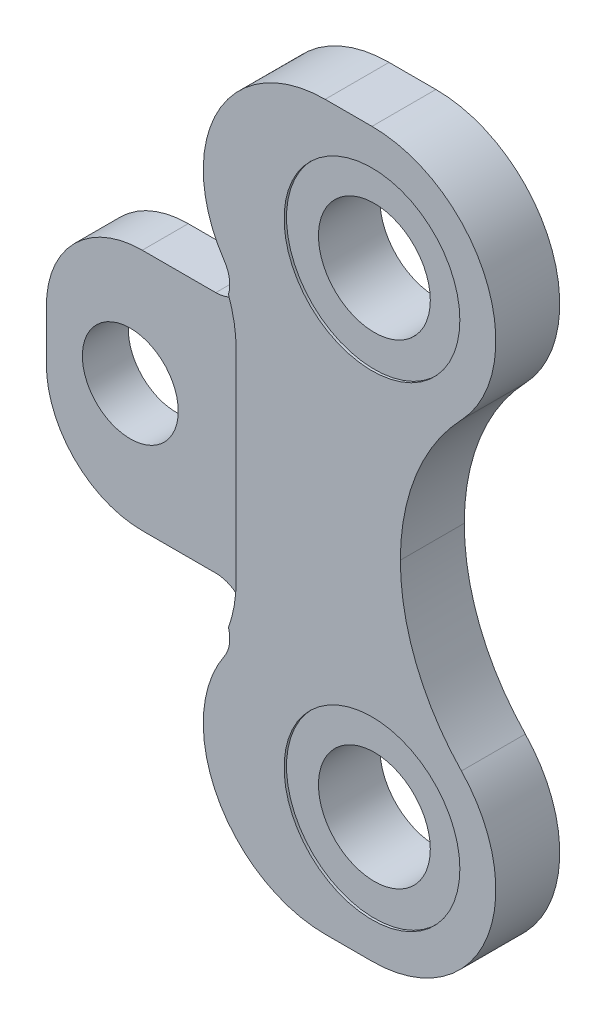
from build123d import *
from build123d.topology import SkipClean

# Parameters (mm, degrees)
ESQUISSE1_R      = 7
EXTRUSION1_DEPTH = 8
ESQUISSE2_R      = 11
EXTRUSION2_DEPTH = 0.3
EXTRUSION3_DEPTH = 2.25


with BuildPart() as part:
    # Esquisse1 → Extrusion1 (new body)
    with BuildSketch(Plane.XY):
        with BuildLine():
            Line((-10.5, 0), (-6, 0))
            ThreePointArc((-6, 0), (0, 6), (6, 0))
            Line((6, 0), (36.05000014, 0))
            ThreePointArc((36.05000014, 0), (38.03152037, 10.252514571), (43.69244186, 19.027162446))
            ThreePointArc((43.69244186, 19.027162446), (46.755770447, 35.834653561), (32.5, 45.25))
            Line((32.5, 45.25), (26.636075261, 45.25))
            ThreePointArc((26.636075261, 45.25), (13.163529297, 37.145138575), (14.011392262, 21.445476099))
            ThreePointArc((14.011392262, 21.445476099), (14.233782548, 17.327531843), (10.7, 15.201666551))
            Line((10.7, 15.201666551), (1.5, 15.201666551))
            ThreePointArc((1.5, 15.201666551), (-7.056878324, 11.615452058), (-10.5, 3))
            Line((-10.5, 3), (-10.5, 0))
        make_face()
        with Locations((32.5, 29.75)):
            Circle(ESQUISSE1_R, mode=Mode.SUBTRACT)
    extrusion1 = extrude(amount=EXTRUSION1_DEPTH)

    # Esquisse2 → Extrusion2 (cut)
    with BuildSketch(Plane.XY.offset(8)):
        with Locations((32.5, 29.75)):
            Circle(ESQUISSE2_R)
    extrusion2 = extrude(amount=-EXTRUSION2_DEPTH, mode=Mode.SUBTRACT)

    # Esquisse3 → Extrusion3 (cut)
    with BuildSketch(Plane.XY.offset(8)):
        with BuildLine():
            Line((15.5, 12.5), (15.5, 0))
            Line((15.5, 0), (-15.915309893, 0))
            Line((-15.915309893, 0), (-15.915309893, 28.765108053))
            Line((-15.915309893, 28.765108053), (1.774213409, 28.765108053))
            ThreePointArc((1.774213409, 28.765108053), (11.610006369, 23.141322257), (15.5, 12.5))
        make_face()
    extrusion3 = extrude(amount=-EXTRUSION3_DEPTH, mode=Mode.SUBTRACT)

    # Sym_trie1: Extrusion1, Extrusion2, Extrusion3 across plane
    with SkipClean():  # the faces are left unmerged after this step: merging them gives an invalid solid
        add(extrusion1.mirror(Plane(origin=(6, 0, 8), x_dir=(0, 0, 1), z_dir=(0, 1, 0))))
        add(extrusion2.mirror(Plane(origin=(6, 0, 8), x_dir=(0, 0, 1), z_dir=(0, 1, 0))), mode=Mode.SUBTRACT)
        add(extrusion3.mirror(Plane(origin=(6, 0, 8), x_dir=(0, 0, 1), z_dir=(0, 1, 0))), mode=Mode.SUBTRACT)


solid = part.part
